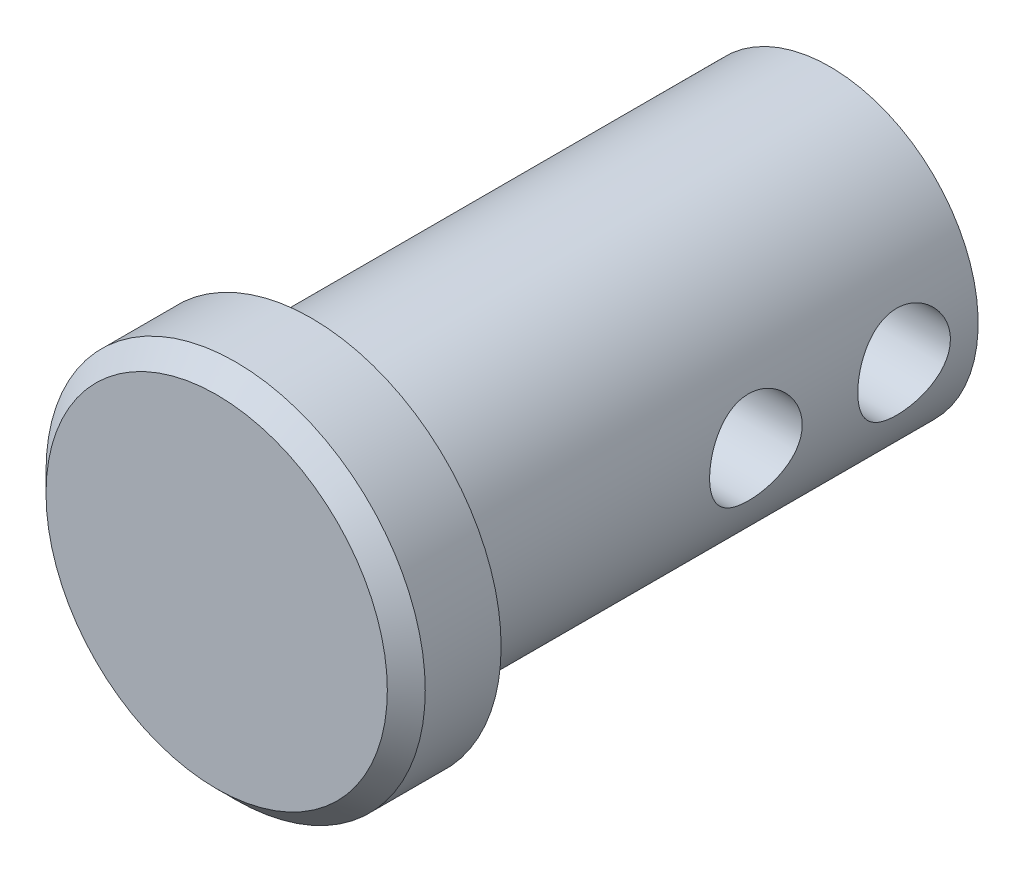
from build123d import *

# Parameters (mm, degrees)
SKETCH1_R               = 6.35
EXTRUDE1_DEPTH          = 25.4
SKETCH2_R               = 8.128
EXTRUDE2_DEPTH          = 4.064
CHAMFER1_SIZE           = 0.8128
SKETCH3_R               = 1.984375
EXTRUDE3_DEPTH          = 32.62682507
LPATTERN1_COUNT         = 6
LPATTERN1_PITCH         = 6.35
CHAMFER2_SIZE           = 0.635
CUT_EXTRUDE1_DEPTH      = 32.62682507
CUT_EXTRUDE1_DEPTH_BACK = 32.62682507


with BuildPart() as part:
    # Sketch1 → Extrude1 (new, symmetric)
    with BuildSketch(Plane.XY):
        Circle(SKETCH1_R)
    extrude(amount=EXTRUDE1_DEPTH, both=True)

    # Sketch2 → Extrude2 (add)
    with BuildSketch(Plane.XY.offset(25.4)):
        Circle(SKETCH2_R)
    extrude(amount=EXTRUDE2_DEPTH)

    # Chamfer1
    chamfer1_edges = [part.edges().sort_by_distance(p)[0] for p in [
        (-8.128, 0, 29.464),
    ]]
    chamfer(chamfer1_edges, length=CHAMFER1_SIZE)

    # Sketch3 → Extrude3 (cut, symmetric)
    with BuildSketch(Plane(origin=(0, 0, 0), x_dir=(0, 0, -1), z_dir=(1, 0, 0))):
        with Locations(Location((19.05, 0, 0), (0, 0, 179.999999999))):
            Circle(SKETCH3_R)
    extrude3 = extrude(amount=EXTRUDE3_DEPTH, both=True, mode=Mode.SUBTRACT)

    # LPattern1: Extrude3 ×6
    with Locations(*[(0, 0, i * LPATTERN1_PITCH) for i in range(1, LPATTERN1_COUNT)]):
        add(extrude3, mode=Mode.SUBTRACT)

    # Chamfer2
    chamfer2_edges = [part.edges().sort_by_distance(p)[0] for p in [
        (-6.35, 0, -25.4),
    ]]
    chamfer(chamfer2_edges, length=CHAMFER2_SIZE)

    # Sketch9 → Cut-Extrude1 (cut, two sides: drawn at the far end of the back side and taken through both)
    with BuildSketch(Plane(origin=(0, 0, 0), x_dir=(0, 0, -1), z_dir=(1, 0, 0)).offset(-CUT_EXTRUDE1_DEPTH_BACK)):
        Polygon((-3.175, 80.416937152), (-3.175, 6.35), (-3.175, -6.35), (-3.175, -80.416937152), (144.958874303, -80.416937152), (144.958874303, 80.416937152), align=None)
    extrude(amount=CUT_EXTRUDE1_DEPTH + CUT_EXTRUDE1_DEPTH_BACK, mode=Mode.SUBTRACT)


solid = part.part
